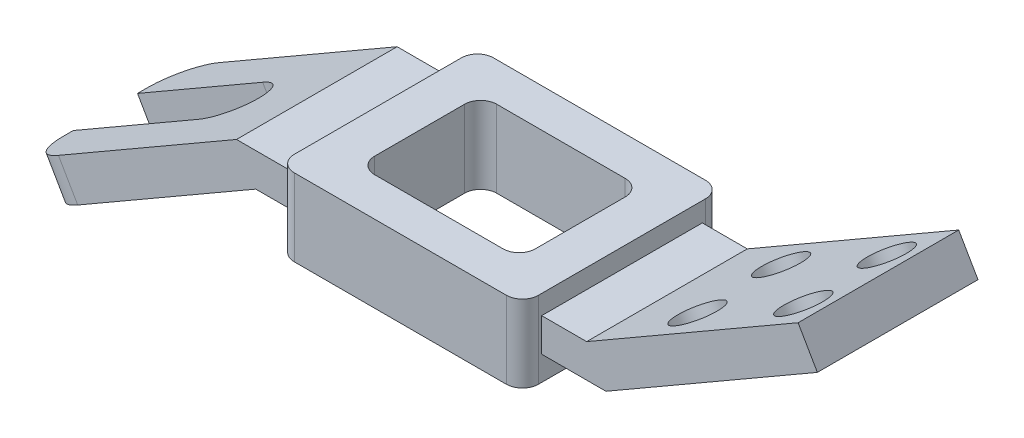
from build123d import *

# Parameters (mm, degrees)
BOSS_EXTRUDE1_DEPTH      = 50
BOSS_EXTRUDE2_DEPTH      = 6
BOSS_EXTRUDE2_DEPTH_BACK = 18
SKETCH2_W                = 76
SKETCH2_H                = 62
SKETCH3_W                = 50
SKETCH3_H                = 38
CUT_EXTRUDE1_DEPTH       = 147.374187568
CUT_EXTRUDE2_DEPTH       = 166.94748319
SKETCH5_R                = 7
CUT_EXTRUDE3_DEPTH       = 159.886048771
FILLET1_R                = 12
FILLET2_R                = 5


with BuildPart() as part:
    # Sketch1 → Boss-Extrude1 (new body)
    with BuildSketch(Plane.XY):
        Polygon((-38, 0), (38, 0), (52, 0), (117.817930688, 38), (123.817930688, 27.607695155), (58, -10.392304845), (38, -10.392304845), (-38, -10.392304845), (-51, -10.392304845), (-116.817930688, -48.392304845), (-122.817930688, -38), (-57, 0), align=None)
    extrude(amount=BOSS_EXTRUDE1_DEPTH)

    # Sketch2 → Boss-Extrude2 (add, two sides: drawn at the far end of the back side and taken through both)
    with BuildSketch(Plane(origin=(0, 0, 0), x_dir=(1, 0, 0), z_dir=(0, 1, 0)).offset(-BOSS_EXTRUDE2_DEPTH_BACK)):
        with Locations((0, -25)):
            Rectangle(SKETCH2_W, SKETCH2_H)
    extrude(amount=BOSS_EXTRUDE2_DEPTH + BOSS_EXTRUDE2_DEPTH_BACK)

    # Sketch3 → Cut-Extrude1 (cut, through all)
    with BuildSketch(Plane(origin=(0, 6, 0), x_dir=(1, 0, 0), z_dir=(0, 1, 0))):
        with Locations((0, -25)):
            Rectangle(SKETCH3_W, SKETCH3_H)
    extrude(amount=-CUT_EXTRUDE1_DEPTH, mode=Mode.SUBTRACT)

    # Sketch4 → Cut-Extrude2 (cut, through all)
    with BuildSketch(Plane(origin=(-14.25, 24.681724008, 0), x_dir=(0.8660254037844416, 0.4999999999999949, 0), z_dir=(-0.4999999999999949, 0.8660254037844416, 0))):
        with BuildLine():
            Line((-80.363448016, -15), (-125.363448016, -15))
            Line((-125.363448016, -15), (-125.363448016, -35))
            Line((-125.363448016, -35), (-80.363448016, -35))
            ThreePointArc((-80.363448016, -35), (-70.363448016, -25), (-80.363448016, -15))
        make_face()
    extrude(amount=-CUT_EXTRUDE2_DEPTH, mode=Mode.SUBTRACT)

    # Sketch5 → Cut-Extrude3 (cut, through all)
    with BuildSketch(Plane(origin=(13, -22.516660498, 0), x_dir=(0.8660254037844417, 0.4999999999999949, 0), z_dir=(-0.4999999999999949, 0.8660254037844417, 0))):
        with Locations(Location((109.033320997, -12, 0), (0, 0, 180))):
            Circle(SKETCH5_R)
        with Locations(Location((71.033320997, -12, 0), (0, 0, 180))):
            Circle(SKETCH5_R)
        with Locations(Location((71.033320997, -38, 0), (0, 0, 180))):
            Circle(SKETCH5_R)
        with Locations(Location((109.033320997, -38, 0), (0, 0, 180))):
            Circle(SKETCH5_R)
    extrude(amount=-CUT_EXTRUDE3_DEPTH, mode=Mode.SUBTRACT)

    # Fillet1
    fillet1_edges = [part.edges().sort_by_distance(p)[0] for p in [
        (-119.817930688, -43.196152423, 0),
        (-119.817930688, -43.196152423, 50),
    ]]
    fillet(fillet1_edges, radius=FILLET1_R)

    # Fillet2
    fillet2_edges = [part.edges().sort_by_distance(p)[0] for p in [
        (-38, -6, 56),
        (38, -6, -6),
        (-38, -6, -6),
        (38, -6, 56),
        (-25, -6, 44),
        (-25, -6, 6),
        (25, -6, 6),
        (25, -6, 44),
    ]]
    fillet(fillet2_edges, radius=FILLET2_R)


solid = part.part
